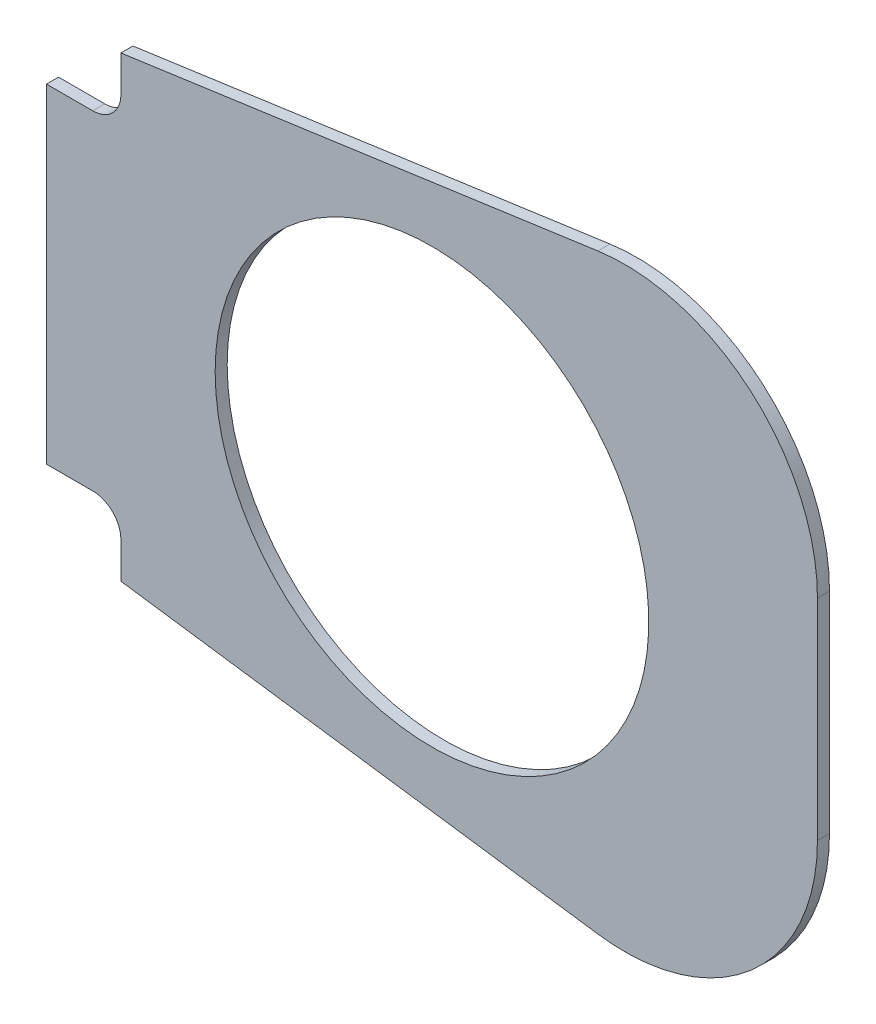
ISO-10303-21;
HEADER;
FILE_DESCRIPTION(('STEP AP214'),'2;1');
FILE_NAME('part.step','',(''),(''),'','','');
FILE_SCHEMA(('AUTOMOTIVE_DESIGN { 1 0 10303 214 1 1 1 1 }'));
ENDSEC;
DATA;
#1=APPLICATION_CONTEXT('core data for automotive mechanical design processes');
#2=APPLICATION_PROTOCOL_DEFINITION('international standard','automotive_design',2000,#1);
#3=PRODUCT_CONTEXT('',#1,'mechanical');
#4=PRODUCT('Part','Part','',(#3));
#5=PRODUCT_RELATED_PRODUCT_CATEGORY('part','',(#4));
#6=PRODUCT_DEFINITION_FORMATION('','',#4);
#7=PRODUCT_DEFINITION_CONTEXT('part definition',#1,'design');
#8=PRODUCT_DEFINITION('design','',#6,#7);
#9=PRODUCT_DEFINITION_SHAPE('','',#8);
#10=(LENGTH_UNIT() NAMED_UNIT(*) SI_UNIT(.MILLI.,.METRE.));
#11=(NAMED_UNIT(*) PLANE_ANGLE_UNIT() SI_UNIT($,.RADIAN.));
#12=(NAMED_UNIT(*) SI_UNIT($,.STERADIAN.) SOLID_ANGLE_UNIT());
#13=UNCERTAINTY_MEASURE_WITH_UNIT(LENGTH_MEASURE(1.E-05),#10,'distance_accuracy_value','');
#14=(GEOMETRIC_REPRESENTATION_CONTEXT(3) GLOBAL_UNCERTAINTY_ASSIGNED_CONTEXT((#13)) GLOBAL_UNIT_ASSIGNED_CONTEXT((#10,
#11,#12)) REPRESENTATION_CONTEXT('',''));
#15=CARTESIAN_POINT('',(0.,0.,0.));
#16=DIRECTION('',(0.,0.,1.));
#17=DIRECTION('',(1.,0.,0.));
#18=AXIS2_PLACEMENT_3D('',#15,#16,#17);
#19=CARTESIAN_POINT('',(1.52400000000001,-6.35,0.1984375));
#20=DIRECTION('',(0.,0.,-0.999999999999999));
#21=DIRECTION('',(-1.,0.,0.));
#22=AXIS2_PLACEMENT_3D('',#19,#20,#21);
#23=PLANE('',#22);
#24=DIRECTION('',(0.990268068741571,-0.139173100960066,0.));
#25=VECTOR('',#24,1.);
#26=CARTESIAN_POINT('',(18.1662508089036,-9.74559857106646,0.1984375));
#27=LINE('',#26,#25);
#28=CARTESIAN_POINT('',(2.4511,-7.53697815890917,0.1984375));
#29=VERTEX_POINT('',#28);
#30=CARTESIAN_POINT('',(18.1662508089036,-9.74559857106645,0.1984375));
#31=VERTEX_POINT('',#30);
#32=EDGE_CURVE('E180',#29,#31,#27,.T.);
#33=ORIENTED_EDGE('',*,*,#32,.T.);
#34=CARTESIAN_POINT('',(19.05,-3.45739633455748,0.1984375));
#35=DIRECTION('',(0.,0.,0.999999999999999));
#36=DIRECTION('',(-1.,0.,0.));
#37=AXIS2_PLACEMENT_3D('',#34,#35,#36);
#38=CIRCLE('',#37,6.35);
#39=CARTESIAN_POINT('',(25.4,-3.45739633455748,0.1984375));
#40=VERTEX_POINT('',#39);
#41=EDGE_CURVE('E108',#31,#40,#38,.T.);
#42=ORIENTED_EDGE('',*,*,#41,.T.);
#43=DIRECTION('',(0.,1.,0.));
#44=VECTOR('',#43,1.);
#45=CARTESIAN_POINT('',(25.4,-3.45739633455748,0.1984375));
#46=LINE('',#45,#44);
#47=CARTESIAN_POINT('',(25.4,3.45739633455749,0.1984375));
#48=VERTEX_POINT('',#47);
#49=EDGE_CURVE('E207',#40,#48,#46,.T.);
#50=ORIENTED_EDGE('',*,*,#49,.T.);
#51=CARTESIAN_POINT('',(19.05,3.45739633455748,0.1984375));
#52=DIRECTION('',(0.,0.,0.999999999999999));
#53=DIRECTION('',(1.,0.,0.));
#54=AXIS2_PLACEMENT_3D('',#51,#52,#53);
#55=CIRCLE('',#54,6.35);
#56=CARTESIAN_POINT('',(18.1662508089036,9.74559857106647,0.1984375));
#57=VERTEX_POINT('',#56);
#58=EDGE_CURVE('E226',#48,#57,#55,.T.);
#59=ORIENTED_EDGE('',*,*,#58,.T.);
#60=DIRECTION('',(-0.990268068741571,-0.139173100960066,0.));
#61=VECTOR('',#60,1.);
#62=CARTESIAN_POINT('',(18.1662508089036,9.74559857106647,0.1984375));
#63=LINE('',#62,#61);
#64=CARTESIAN_POINT('',(2.4511,7.53697815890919,0.1984375));
#65=VERTEX_POINT('',#64);
#66=EDGE_CURVE('E223',#57,#65,#63,.T.);
#67=ORIENTED_EDGE('',*,*,#66,.T.);
#68=DIRECTION('',(0.,-1.,0.));
#69=VECTOR('',#68,1.);
#70=CARTESIAN_POINT('',(2.4511,7.53697815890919,0.1984375));
#71=LINE('',#70,#69);
#72=CARTESIAN_POINT('',(2.4511,6.34999999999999,0.1984375));
#73=VERTEX_POINT('',#72);
#74=EDGE_CURVE('E225',#65,#73,#71,.T.);
#75=ORIENTED_EDGE('',*,*,#74,.T.);
#76=CARTESIAN_POINT('',(1.524,6.35000000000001,0.1984375));
#77=DIRECTION('',(0.,0.,-0.999999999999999));
#78=DIRECTION('',(1.,0.,0.));
#79=AXIS2_PLACEMENT_3D('',#76,#77,#78);
#80=CIRCLE('',#79,0.927099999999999);
#81=CARTESIAN_POINT('',(1.52400000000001,5.42290000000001,0.1984375));
#82=VERTEX_POINT('',#81);
#83=EDGE_CURVE('E228',#73,#82,#80,.T.);
#84=ORIENTED_EDGE('',*,*,#83,.T.);
#85=DIRECTION('',(-1.,0.,0.));
#86=VECTOR('',#85,1.);
#87=CARTESIAN_POINT('',(0.,5.4229,0.1984375));
#88=LINE('',#87,#86);
#89=CARTESIAN_POINT('',(0.,5.4229,0.1984375));
#90=VERTEX_POINT('',#89);
#91=EDGE_CURVE('E234',#82,#90,#88,.T.);
#92=ORIENTED_EDGE('',*,*,#91,.T.);
#93=DIRECTION('',(0.,-1.,0.));
#94=VECTOR('',#93,1.);
#95=CARTESIAN_POINT('',(0.,-5.4229,0.1984375));
#96=LINE('',#95,#94);
#97=CARTESIAN_POINT('',(0.,-5.4229,0.1984375));
#98=VERTEX_POINT('',#97);
#99=EDGE_CURVE('E139',#90,#98,#96,.T.);
#100=ORIENTED_EDGE('',*,*,#99,.T.);
#101=DIRECTION('',(1.,0.,0.));
#102=VECTOR('',#101,1.);
#103=CARTESIAN_POINT('',(0.,-5.4229,0.1984375));
#104=LINE('',#103,#102);
#105=CARTESIAN_POINT('',(1.524,-5.42289999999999,0.1984375));
#106=VERTEX_POINT('',#105);
#107=EDGE_CURVE('E133',#98,#106,#104,.T.);
#108=ORIENTED_EDGE('',*,*,#107,.T.);
#109=CARTESIAN_POINT('',(1.52400000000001,-6.35,0.1984375));
#110=DIRECTION('',(0.,0.,-0.999999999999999));
#111=DIRECTION('',(-1.,0.,0.));
#112=AXIS2_PLACEMENT_3D('',#109,#110,#111);
#113=CIRCLE('',#112,0.9271);
#114=CARTESIAN_POINT('',(2.4511,-6.35,0.1984375));
#115=VERTEX_POINT('',#114);
#116=EDGE_CURVE('E137',#106,#115,#113,.T.);
#117=ORIENTED_EDGE('',*,*,#116,.T.);
#118=DIRECTION('',(0.,-1.,0.));
#119=VECTOR('',#118,1.);
#120=CARTESIAN_POINT('',(2.4511,-6.35,0.1984375));
#121=LINE('',#120,#119);
#122=EDGE_CURVE('E53',#115,#29,#121,.T.);
#123=ORIENTED_EDGE('',*,*,#122,.T.);
#124=EDGE_LOOP('',(#33,#42,#50,#59,#67,#75,#84,#92,#100,#108,#117,#123));
#125=FACE_BOUND('',#124,.T.);
#126=CARTESIAN_POINT('',(12.7,0.,0.1984375));
#127=DIRECTION('',(0.,0.,0.999999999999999));
#128=DIRECTION('',(1.,0.,0.));
#129=AXIS2_PLACEMENT_3D('',#126,#127,#128);
#130=CIRCLE('',#129,7.14375);
#131=CARTESIAN_POINT('',(5.55625000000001,0.,0.1984375));
#132=VERTEX_POINT('',#131);
#133=EDGE_CURVE('E161',#132,#132,#130,.T.);
#134=ORIENTED_EDGE('',*,*,#133,.F.);
#135=EDGE_LOOP('',(#134));
#136=FACE_BOUND('',#135,.T.);
#137=ADVANCED_FACE('F36',(#125,#136),#23,.F.);
#138=CARTESIAN_POINT('',(1.52400000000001,-6.35,-0.1984375));
#139=DIRECTION('',(0.,0.,-0.999999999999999));
#140=DIRECTION('',(-1.,0.,0.));
#141=AXIS2_PLACEMENT_3D('',#138,#139,#140);
#142=PLANE('',#141);
#143=DIRECTION('',(0.990268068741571,-0.139173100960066,0.));
#144=VECTOR('',#143,1.);
#145=CARTESIAN_POINT('',(18.1662508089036,-9.74559857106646,-0.1984375));
#146=LINE('',#145,#144);
#147=CARTESIAN_POINT('',(2.4511,-7.53697815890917,-0.1984375));
#148=VERTEX_POINT('',#147);
#149=CARTESIAN_POINT('',(18.1662508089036,-9.74559857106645,-0.1984375));
#150=VERTEX_POINT('',#149);
#151=EDGE_CURVE('E157',#148,#150,#146,.T.);
#152=ORIENTED_EDGE('',*,*,#151,.F.);
#153=DIRECTION('',(0.,-1.,0.));
#154=VECTOR('',#153,1.);
#155=CARTESIAN_POINT('',(2.4511,-6.35,-0.1984375));
#156=LINE('',#155,#154);
#157=CARTESIAN_POINT('',(2.4511,-6.35,-0.1984375));
#158=VERTEX_POINT('',#157);
#159=EDGE_CURVE('E100',#158,#148,#156,.T.);
#160=ORIENTED_EDGE('',*,*,#159,.F.);
#161=CARTESIAN_POINT('',(1.52400000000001,-6.35,-0.1984375));
#162=DIRECTION('',(0.,0.,-0.999999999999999));
#163=DIRECTION('',(-1.,0.,0.));
#164=AXIS2_PLACEMENT_3D('',#161,#162,#163);
#165=CIRCLE('',#164,0.9271);
#166=CARTESIAN_POINT('',(1.52400000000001,-5.4229,-0.1984375));
#167=VERTEX_POINT('',#166);
#168=EDGE_CURVE('E94',#167,#158,#165,.T.);
#169=ORIENTED_EDGE('',*,*,#168,.F.);
#170=DIRECTION('',(1.,0.,0.));
#171=VECTOR('',#170,1.);
#172=CARTESIAN_POINT('',(0.,-5.4229,-0.1984375));
#173=LINE('',#172,#171);
#174=CARTESIAN_POINT('',(0.,-5.4229,-0.1984375));
#175=VERTEX_POINT('',#174);
#176=EDGE_CURVE('E147',#175,#167,#173,.T.);
#177=ORIENTED_EDGE('',*,*,#176,.F.);
#178=DIRECTION('',(0.,-1.,0.));
#179=VECTOR('',#178,1.);
#180=CARTESIAN_POINT('',(0.,-5.4229,-0.1984375));
#181=LINE('',#180,#179);
#182=CARTESIAN_POINT('',(0.,5.4229,-0.1984375));
#183=VERTEX_POINT('',#182);
#184=EDGE_CURVE('E175',#183,#175,#181,.T.);
#185=ORIENTED_EDGE('',*,*,#184,.F.);
#186=DIRECTION('',(-1.,0.,0.));
#187=VECTOR('',#186,1.);
#188=CARTESIAN_POINT('',(0.,5.4229,-0.1984375));
#189=LINE('',#188,#187);
#190=CARTESIAN_POINT('',(1.52400000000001,5.42290000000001,-0.1984375));
#191=VERTEX_POINT('',#190);
#192=EDGE_CURVE('E173',#191,#183,#189,.T.);
#193=ORIENTED_EDGE('',*,*,#192,.F.);
#194=CARTESIAN_POINT('',(1.524,6.35000000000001,-0.1984375));
#195=DIRECTION('',(0.,0.,-0.999999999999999));
#196=DIRECTION('',(1.,0.,0.));
#197=AXIS2_PLACEMENT_3D('',#194,#195,#196);
#198=CIRCLE('',#197,0.927099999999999);
#199=CARTESIAN_POINT('',(2.4511,6.34999999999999,-0.1984375));
#200=VERTEX_POINT('',#199);
#201=EDGE_CURVE('E171',#200,#191,#198,.T.);
#202=ORIENTED_EDGE('',*,*,#201,.F.);
#203=DIRECTION('',(0.,-1.,0.));
#204=VECTOR('',#203,1.);
#205=CARTESIAN_POINT('',(2.4511,7.53697815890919,-0.1984375));
#206=LINE('',#205,#204);
#207=CARTESIAN_POINT('',(2.4511,7.53697815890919,-0.1984375));
#208=VERTEX_POINT('',#207);
#209=EDGE_CURVE('E169',#208,#200,#206,.T.);
#210=ORIENTED_EDGE('',*,*,#209,.F.);
#211=DIRECTION('',(-0.990268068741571,-0.139173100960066,0.));
#212=VECTOR('',#211,1.);
#213=CARTESIAN_POINT('',(18.1662508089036,9.74559857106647,-0.1984375));
#214=LINE('',#213,#212);
#215=CARTESIAN_POINT('',(18.1662508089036,9.74559857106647,-0.1984375));
#216=VERTEX_POINT('',#215);
#217=EDGE_CURVE('E167',#216,#208,#214,.T.);
#218=ORIENTED_EDGE('',*,*,#217,.F.);
#219=CARTESIAN_POINT('',(19.05,3.45739633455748,-0.1984375));
#220=DIRECTION('',(0.,0.,0.999999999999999));
#221=DIRECTION('',(1.,0.,0.));
#222=AXIS2_PLACEMENT_3D('',#219,#220,#221);
#223=CIRCLE('',#222,6.35);
#224=CARTESIAN_POINT('',(25.4,3.45739633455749,-0.1984375));
#225=VERTEX_POINT('',#224);
#226=EDGE_CURVE('E165',#225,#216,#223,.T.);
#227=ORIENTED_EDGE('',*,*,#226,.F.);
#228=DIRECTION('',(0.,1.,0.));
#229=VECTOR('',#228,1.);
#230=CARTESIAN_POINT('',(25.4,-3.45739633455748,-0.1984375));
#231=LINE('',#230,#229);
#232=CARTESIAN_POINT('',(25.4,-3.45739633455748,-0.1984375));
#233=VERTEX_POINT('',#232);
#234=EDGE_CURVE('E163',#233,#225,#231,.T.);
#235=ORIENTED_EDGE('',*,*,#234,.F.);
#236=CARTESIAN_POINT('',(19.05,-3.45739633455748,-0.1984375));
#237=DIRECTION('',(0.,0.,0.999999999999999));
#238=DIRECTION('',(-1.,0.,0.));
#239=AXIS2_PLACEMENT_3D('',#236,#237,#238);
#240=CIRCLE('',#239,6.35);
#241=EDGE_CURVE('E160',#150,#233,#240,.T.);
#242=ORIENTED_EDGE('',*,*,#241,.F.);
#243=EDGE_LOOP('',(#152,#160,#169,#177,#185,#193,#202,#210,#218,#227,#235,#242));
#244=FACE_BOUND('',#243,.T.);
#245=CARTESIAN_POINT('',(12.7,0.,-0.1984375));
#246=DIRECTION('',(0.,0.,0.999999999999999));
#247=DIRECTION('',(1.,0.,0.));
#248=AXIS2_PLACEMENT_3D('',#245,#246,#247);
#249=CIRCLE('',#248,7.14375);
#250=CARTESIAN_POINT('',(5.55625000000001,0.,-0.1984375));
#251=VERTEX_POINT('',#250);
#252=EDGE_CURVE('E351',#251,#251,#249,.T.);
#253=ORIENTED_EDGE('',*,*,#252,.T.);
#254=EDGE_LOOP('',(#253));
#255=FACE_BOUND('',#254,.T.);
#256=ADVANCED_FACE('F211',(#244,#255),#142,.T.);
#257=CARTESIAN_POINT('',(18.1662508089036,-9.74559857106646,0.1984375));
#258=DIRECTION('',(0.139173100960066,0.990268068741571,0.));
#259=DIRECTION('',(-0.990268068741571,0.139173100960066,0.));
#260=AXIS2_PLACEMENT_3D('',#257,#258,#259);
#261=PLANE('',#260);
#262=ORIENTED_EDGE('',*,*,#151,.T.);
#263=DIRECTION('',(0.,0.,-0.999999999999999));
#264=VECTOR('',#263,1.);
#265=CARTESIAN_POINT('',(18.1662508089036,-9.74559857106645,0.1984375));
#266=LINE('',#265,#264);
#267=EDGE_CURVE('E11',#31,#150,#266,.T.);
#268=ORIENTED_EDGE('',*,*,#267,.F.);
#269=ORIENTED_EDGE('',*,*,#32,.F.);
#270=DIRECTION('',(0.,0.,-0.999999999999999));
#271=VECTOR('',#270,1.);
#272=CARTESIAN_POINT('',(2.4511,-7.53697815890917,0.1984375));
#273=LINE('',#272,#271);
#274=EDGE_CURVE('E153',#29,#148,#273,.T.);
#275=ORIENTED_EDGE('',*,*,#274,.T.);
#276=EDGE_LOOP('',(#262,#268,#269,#275));
#277=FACE_BOUND('',#276,.T.);
#278=ADVANCED_FACE('F38',(#277),#261,.F.);
#279=CARTESIAN_POINT('',(19.05,-3.45739633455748,0.1984375));
#280=DIRECTION('',(0.,0.,-0.999999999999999));
#281=DIRECTION('',(-1.,0.,0.));
#282=AXIS2_PLACEMENT_3D('',#279,#280,#281);
#283=CYLINDRICAL_SURFACE('',#282,6.35);
#284=ORIENTED_EDGE('',*,*,#241,.T.);
#285=DIRECTION('',(0.,0.,-0.999999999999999));
#286=VECTOR('',#285,1.);
#287=CARTESIAN_POINT('',(25.4,-3.45739633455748,0.1984375));
#288=LINE('',#287,#286);
#289=EDGE_CURVE('E45',#40,#233,#288,.T.);
#290=ORIENTED_EDGE('',*,*,#289,.F.);
#291=ORIENTED_EDGE('',*,*,#41,.F.);
#292=ORIENTED_EDGE('',*,*,#267,.T.);
#293=EDGE_LOOP('',(#284,#290,#291,#292));
#294=FACE_BOUND('',#293,.T.);
#295=ADVANCED_FACE('F268',(#294),#283,.T.);
#296=CARTESIAN_POINT('',(25.4,-3.45739633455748,0.1984375));
#297=DIRECTION('',(-1.,0.,0.));
#298=DIRECTION('',(0.,-1.,0.));
#299=AXIS2_PLACEMENT_3D('',#296,#297,#298);
#300=PLANE('',#299);
#301=ORIENTED_EDGE('',*,*,#234,.T.);
#302=DIRECTION('',(0.,0.,-0.999999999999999));
#303=VECTOR('',#302,1.);
#304=CARTESIAN_POINT('',(25.4,3.45739633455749,0.1984375));
#305=LINE('',#304,#303);
#306=EDGE_CURVE('E199',#48,#225,#305,.T.);
#307=ORIENTED_EDGE('',*,*,#306,.F.);
#308=ORIENTED_EDGE('',*,*,#49,.F.);
#309=ORIENTED_EDGE('',*,*,#289,.T.);
#310=EDGE_LOOP('',(#301,#307,#308,#309));
#311=FACE_BOUND('',#310,.T.);
#312=ADVANCED_FACE('F205',(#311),#300,.F.);
#313=CARTESIAN_POINT('',(19.05,3.45739633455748,0.1984375));
#314=DIRECTION('',(0.,0.,-0.999999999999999));
#315=DIRECTION('',(-1.,0.,0.));
#316=AXIS2_PLACEMENT_3D('',#313,#314,#315);
#317=CYLINDRICAL_SURFACE('',#316,6.35);
#318=ORIENTED_EDGE('',*,*,#226,.T.);
#319=DIRECTION('',(0.,0.,-0.999999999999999));
#320=VECTOR('',#319,1.);
#321=CARTESIAN_POINT('',(18.1662508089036,9.74559857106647,0.1984375));
#322=LINE('',#321,#320);
#323=EDGE_CURVE('E196',#57,#216,#322,.T.);
#324=ORIENTED_EDGE('',*,*,#323,.F.);
#325=ORIENTED_EDGE('',*,*,#58,.F.);
#326=ORIENTED_EDGE('',*,*,#306,.T.);
#327=EDGE_LOOP('',(#318,#324,#325,#326));
#328=FACE_BOUND('',#327,.T.);
#329=ADVANCED_FACE('F217',(#328),#317,.T.);
#330=CARTESIAN_POINT('',(18.1662508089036,9.74559857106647,0.1984375));
#331=DIRECTION('',(0.139173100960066,-0.990268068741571,0.));
#332=DIRECTION('',(0.990268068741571,0.139173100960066,0.));
#333=AXIS2_PLACEMENT_3D('',#330,#331,#332);
#334=PLANE('',#333);
#335=ORIENTED_EDGE('',*,*,#217,.T.);
#336=DIRECTION('',(0.,0.,-0.999999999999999));
#337=VECTOR('',#336,1.);
#338=CARTESIAN_POINT('',(2.4511,7.53697815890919,0.1984375));
#339=LINE('',#338,#337);
#340=EDGE_CURVE('E193',#65,#208,#339,.T.);
#341=ORIENTED_EDGE('',*,*,#340,.F.);
#342=ORIENTED_EDGE('',*,*,#66,.F.);
#343=ORIENTED_EDGE('',*,*,#323,.T.);
#344=EDGE_LOOP('',(#335,#341,#342,#343));
#345=FACE_BOUND('',#344,.T.);
#346=ADVANCED_FACE('F221',(#345),#334,.F.);
#347=CARTESIAN_POINT('',(2.4511,7.53697815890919,0.1984375));
#348=DIRECTION('',(1.,0.,0.));
#349=DIRECTION('',(0.,1.,0.));
#350=AXIS2_PLACEMENT_3D('',#347,#348,#349);
#351=PLANE('',#350);
#352=ORIENTED_EDGE('',*,*,#209,.T.);
#353=DIRECTION('',(0.,0.,-0.999999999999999));
#354=VECTOR('',#353,1.);
#355=CARTESIAN_POINT('',(2.4511,6.34999999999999,0.1984375));
#356=LINE('',#355,#354);
#357=EDGE_CURVE('E190',#73,#200,#356,.T.);
#358=ORIENTED_EDGE('',*,*,#357,.F.);
#359=ORIENTED_EDGE('',*,*,#74,.F.);
#360=ORIENTED_EDGE('',*,*,#340,.T.);
#361=EDGE_LOOP('',(#352,#358,#359,#360));
#362=FACE_BOUND('',#361,.T.);
#363=ADVANCED_FACE('F281',(#362),#351,.F.);
#364=CARTESIAN_POINT('',(1.524,6.35000000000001,0.1984375));
#365=DIRECTION('',(0.,0.,-0.999999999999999));
#366=DIRECTION('',(-1.,0.,0.));
#367=AXIS2_PLACEMENT_3D('',#364,#365,#366);
#368=CYLINDRICAL_SURFACE('',#367,0.927099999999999);
#369=ORIENTED_EDGE('',*,*,#201,.T.);
#370=DIRECTION('',(0.,0.,-0.999999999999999));
#371=VECTOR('',#370,1.);
#372=CARTESIAN_POINT('',(1.52400000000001,5.42290000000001,0.1984375));
#373=LINE('',#372,#371);
#374=EDGE_CURVE('E187',#82,#191,#373,.T.);
#375=ORIENTED_EDGE('',*,*,#374,.F.);
#376=ORIENTED_EDGE('',*,*,#83,.F.);
#377=ORIENTED_EDGE('',*,*,#357,.T.);
#378=EDGE_LOOP('',(#369,#375,#376,#377));
#379=FACE_BOUND('',#378,.T.);
#380=ADVANCED_FACE('F284',(#379),#368,.F.);
#381=CARTESIAN_POINT('',(0.,5.4229,0.1984375));
#382=DIRECTION('',(0.,-1.,0.));
#383=DIRECTION('',(0.,0.,-0.999999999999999));
#384=AXIS2_PLACEMENT_3D('',#381,#382,#383);
#385=PLANE('',#384);
#386=ORIENTED_EDGE('',*,*,#192,.T.);
#387=DIRECTION('',(0.,0.,-0.999999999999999));
#388=VECTOR('',#387,1.);
#389=CARTESIAN_POINT('',(0.,5.4229,0.1984375));
#390=LINE('',#389,#388);
#391=EDGE_CURVE('E184',#90,#183,#390,.T.);
#392=ORIENTED_EDGE('',*,*,#391,.F.);
#393=ORIENTED_EDGE('',*,*,#91,.F.);
#394=ORIENTED_EDGE('',*,*,#374,.T.);
#395=EDGE_LOOP('',(#386,#392,#393,#394));
#396=FACE_BOUND('',#395,.T.);
#397=ADVANCED_FACE('F240',(#396),#385,.F.);
#398=CARTESIAN_POINT('',(0.,-5.4229,0.1984375));
#399=DIRECTION('',(1.,0.,0.));
#400=DIRECTION('',(0.,0.,-0.999999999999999));
#401=AXIS2_PLACEMENT_3D('',#398,#399,#400);
#402=PLANE('',#401);
#403=ORIENTED_EDGE('',*,*,#184,.T.);
#404=DIRECTION('',(0.,0.,-0.999999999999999));
#405=VECTOR('',#404,1.);
#406=CARTESIAN_POINT('',(0.,-5.4229,0.1984375));
#407=LINE('',#406,#405);
#408=EDGE_CURVE('E148',#98,#175,#407,.T.);
#409=ORIENTED_EDGE('',*,*,#408,.F.);
#410=ORIENTED_EDGE('',*,*,#99,.F.);
#411=ORIENTED_EDGE('',*,*,#391,.T.);
#412=EDGE_LOOP('',(#403,#409,#410,#411));
#413=FACE_BOUND('',#412,.T.);
#414=ADVANCED_FACE('F244',(#413),#402,.F.);
#415=CARTESIAN_POINT('',(0.,-5.4229,0.1984375));
#416=DIRECTION('',(0.,1.,0.));
#417=DIRECTION('',(0.,0.,0.999999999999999));
#418=AXIS2_PLACEMENT_3D('',#415,#416,#417);
#419=PLANE('',#418);
#420=ORIENTED_EDGE('',*,*,#176,.T.);
#421=DIRECTION('',(0.,0.,-0.999999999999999));
#422=VECTOR('',#421,1.);
#423=CARTESIAN_POINT('',(1.524,-5.42289999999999,0.1984375));
#424=LINE('',#423,#422);
#425=EDGE_CURVE('E144',#106,#167,#424,.T.);
#426=ORIENTED_EDGE('',*,*,#425,.F.);
#427=ORIENTED_EDGE('',*,*,#107,.F.);
#428=ORIENTED_EDGE('',*,*,#408,.T.);
#429=EDGE_LOOP('',(#420,#426,#427,#428));
#430=FACE_BOUND('',#429,.T.);
#431=ADVANCED_FACE('F145',(#430),#419,.F.);
#432=CARTESIAN_POINT('',(1.52400000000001,-6.35,0.1984375));
#433=DIRECTION('',(0.,0.,-0.999999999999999));
#434=DIRECTION('',(-1.,0.,0.));
#435=AXIS2_PLACEMENT_3D('',#432,#433,#434);
#436=CYLINDRICAL_SURFACE('',#435,0.9271);
#437=ORIENTED_EDGE('',*,*,#168,.T.);
#438=DIRECTION('',(0.,0.,-0.999999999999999));
#439=VECTOR('',#438,1.);
#440=CARTESIAN_POINT('',(2.4511,-6.35,0.1984375));
#441=LINE('',#440,#439);
#442=EDGE_CURVE('E149',#115,#158,#441,.T.);
#443=ORIENTED_EDGE('',*,*,#442,.F.);
#444=ORIENTED_EDGE('',*,*,#116,.F.);
#445=ORIENTED_EDGE('',*,*,#425,.T.);
#446=EDGE_LOOP('',(#437,#443,#444,#445));
#447=FACE_BOUND('',#446,.T.);
#448=ADVANCED_FACE('F151',(#447),#436,.F.);
#449=CARTESIAN_POINT('',(2.4511,-6.35,0.1984375));
#450=DIRECTION('',(1.,0.,0.));
#451=DIRECTION('',(0.,1.,0.));
#452=AXIS2_PLACEMENT_3D('',#449,#450,#451);
#453=PLANE('',#452);
#454=ORIENTED_EDGE('',*,*,#159,.T.);
#455=ORIENTED_EDGE('',*,*,#274,.F.);
#456=ORIENTED_EDGE('',*,*,#122,.F.);
#457=ORIENTED_EDGE('',*,*,#442,.T.);
#458=EDGE_LOOP('',(#454,#455,#456,#457));
#459=FACE_BOUND('',#458,.T.);
#460=ADVANCED_FACE('F248',(#459),#453,.F.);
#461=CARTESIAN_POINT('',(12.7,0.,0.1984375));
#462=DIRECTION('',(0.,0.,-0.999999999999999));
#463=DIRECTION('',(-1.,0.,0.));
#464=AXIS2_PLACEMENT_3D('',#461,#462,#463);
#465=CYLINDRICAL_SURFACE('',#464,7.14375);
#466=CARTESIAN_POINT('',(5.55625000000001,0.,0.1984375));
#467=CARTESIAN_POINT('',(5.55625000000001,0.,0.194303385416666));
#468=CARTESIAN_POINT('',(5.55625000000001,0.,0.190169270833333));
#469=CARTESIAN_POINT('',(5.55625000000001,0.,0.181901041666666));
#470=CARTESIAN_POINT('',(5.55625000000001,0.,0.177766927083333));
#471=CARTESIAN_POINT('',(5.55625000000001,0.,0.169498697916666));
#472=CARTESIAN_POINT('',(5.55625000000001,0.,0.165364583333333));
#473=CARTESIAN_POINT('',(5.55625000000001,0.,0.157096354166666));
#474=CARTESIAN_POINT('',(5.55625000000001,0.,0.152962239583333));
#475=CARTESIAN_POINT('',(5.55625000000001,0.,0.144694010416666));
#476=CARTESIAN_POINT('',(5.55625000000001,0.,0.140559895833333));
#477=CARTESIAN_POINT('',(5.55625000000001,0.,0.132291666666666));
#478=CARTESIAN_POINT('',(5.55625000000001,0.,0.128157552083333));
#479=CARTESIAN_POINT('',(5.55625000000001,0.,0.119889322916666));
#480=CARTESIAN_POINT('',(5.55625000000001,0.,0.115755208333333));
#481=CARTESIAN_POINT('',(5.55625000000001,0.,0.107486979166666));
#482=CARTESIAN_POINT('',(5.55625000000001,0.,0.103352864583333));
#483=CARTESIAN_POINT('',(5.55625000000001,0.,0.0950846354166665));
#484=CARTESIAN_POINT('',(5.55625000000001,0.,0.0909505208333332));
#485=CARTESIAN_POINT('',(5.55625000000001,0.,0.0826822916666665));
#486=CARTESIAN_POINT('',(5.55625000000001,0.,0.0785481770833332));
#487=CARTESIAN_POINT('',(5.55625000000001,0.,0.0702799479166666));
#488=CARTESIAN_POINT('',(5.55625000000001,0.,0.0661458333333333));
#489=CARTESIAN_POINT('',(5.55625000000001,0.,0.0578776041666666));
#490=CARTESIAN_POINT('',(5.55625000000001,0.,0.0537434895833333));
#491=CARTESIAN_POINT('',(5.55625000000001,0.,0.0454752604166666));
#492=CARTESIAN_POINT('',(5.55625000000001,0.,0.0413411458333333));
#493=CARTESIAN_POINT('',(5.55625000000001,0.,0.0330729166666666));
#494=CARTESIAN_POINT('',(5.55625000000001,0.,0.0289388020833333));
#495=CARTESIAN_POINT('',(5.55625000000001,0.,0.0206705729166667));
#496=CARTESIAN_POINT('',(5.55625000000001,0.,0.0165364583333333));
#497=CARTESIAN_POINT('',(5.55625000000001,0.,0.00826822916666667));
#498=CARTESIAN_POINT('',(5.55625000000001,0.,0.00413411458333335));
#499=CARTESIAN_POINT('',(5.55625000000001,0.,-0.0041341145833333));
#500=CARTESIAN_POINT('',(5.55625000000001,0.,-0.00826822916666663));
#501=CARTESIAN_POINT('',(5.55625000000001,0.,-0.0165364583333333));
#502=CARTESIAN_POINT('',(5.55625000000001,0.,-0.0206705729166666));
#503=CARTESIAN_POINT('',(5.55625000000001,0.,-0.0289388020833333));
#504=CARTESIAN_POINT('',(5.55625000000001,0.,-0.0330729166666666));
#505=CARTESIAN_POINT('',(5.55625000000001,0.,-0.0413411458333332));
#506=CARTESIAN_POINT('',(5.55625000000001,0.,-0.0454752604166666));
#507=CARTESIAN_POINT('',(5.55625000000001,0.,-0.0537434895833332));
#508=CARTESIAN_POINT('',(5.55625000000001,0.,-0.0578776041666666));
#509=CARTESIAN_POINT('',(5.55625000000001,0.,-0.0661458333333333));
#510=CARTESIAN_POINT('',(5.55625000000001,0.,-0.0702799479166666));
#511=CARTESIAN_POINT('',(5.55625000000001,0.,-0.0785481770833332));
#512=CARTESIAN_POINT('',(5.55625000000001,0.,-0.0826822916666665));
#513=CARTESIAN_POINT('',(5.55625000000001,0.,-0.0909505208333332));
#514=CARTESIAN_POINT('',(5.55625000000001,0.,-0.0950846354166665));
#515=CARTESIAN_POINT('',(5.55625000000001,0.,-0.103352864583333));
#516=CARTESIAN_POINT('',(5.55625000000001,0.,-0.107486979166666));
#517=CARTESIAN_POINT('',(5.55625000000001,0.,-0.115755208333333));
#518=CARTESIAN_POINT('',(5.55625000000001,0.,-0.119889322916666));
#519=CARTESIAN_POINT('',(5.55625000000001,0.,-0.128157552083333));
#520=CARTESIAN_POINT('',(5.55625000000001,0.,-0.132291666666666));
#521=CARTESIAN_POINT('',(5.55625000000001,0.,-0.140559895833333));
#522=CARTESIAN_POINT('',(5.55625000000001,0.,-0.144694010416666));
#523=CARTESIAN_POINT('',(5.55625000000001,0.,-0.152962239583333));
#524=CARTESIAN_POINT('',(5.55625000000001,0.,-0.157096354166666));
#525=CARTESIAN_POINT('',(5.55625000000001,0.,-0.165364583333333));
#526=CARTESIAN_POINT('',(5.55625000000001,0.,-0.169498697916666));
#527=CARTESIAN_POINT('',(5.55625000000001,0.,-0.177766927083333));
#528=CARTESIAN_POINT('',(5.55625000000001,0.,-0.181901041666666));
#529=CARTESIAN_POINT('',(5.55625000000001,0.,-0.190169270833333));
#530=CARTESIAN_POINT('',(5.55625000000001,0.,-0.194303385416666));
#531=CARTESIAN_POINT('',(5.55625000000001,0.,-0.1984375));
#532=B_SPLINE_CURVE_WITH_KNOTS('',3,(#466,#467,#468,#469,#470,#471,#472,#473,#474,#475,#476,
#477,#478,#479,#480,#481,#482,#483,#484,#485,#486,#487,#488,#489,#490,#491,#492,#493,#494,#495,
#496,#497,#498,#499,#500,#501,#502,#503,#504,#505,#506,#507,#508,#509,#510,#511,#512,#513,#514,
#515,#516,#517,#518,#519,#520,#521,#522,#523,#524,#525,#526,#527,#528,#529,#530,#531),
.UNSPECIFIED.,.F.,.F.,(4,2,2,2,2,2,2,2,2,2,2,2,2,2,2,2,2,2,2,2,2,2,2,2,2,2,2,2,2,2,2,2,4),(0.,
0.01240234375,0.0248046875,0.0372070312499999,0.0496093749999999,0.0620117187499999,
0.0744140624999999,0.0868164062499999,0.0992187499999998,0.11162109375,0.1240234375,
0.13642578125,0.148828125,0.16123046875,0.1736328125,0.18603515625,0.1984375,0.21083984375,
0.2232421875,0.23564453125,0.248046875,0.26044921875,0.2728515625,0.28525390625,0.29765625,
0.310058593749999,0.322460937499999,0.334863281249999,0.347265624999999,0.359667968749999,
0.372070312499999,0.384472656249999,0.396874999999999),.UNSPECIFIED.);
#533=EDGE_CURVE('BSEAM250',#132,#251,#532,.T.);
#534=ORIENTED_EDGE('',*,*,#133,.T.);
#535=ORIENTED_EDGE('',*,*,#252,.F.);
#536=ORIENTED_EDGE('',*,*,#533,.T.);
#537=ORIENTED_EDGE('',*,*,#533,.F.);
#538=EDGE_LOOP('',(#534,#536,#535,#537));
#539=FACE_BOUND('',#538,.T.);
#540=ADVANCED_FACE('F250',(#539),#465,.F.);
#541=CLOSED_SHELL('',(#137,#256,#278,#295,#312,#329,#346,#363,#380,#397,#414,#431,#448,#460,#540));
#542=MANIFOLD_SOLID_BREP('B2',#541);
#543=ADVANCED_BREP_SHAPE_REPRESENTATION('',(#18,#542),#14);
#544=SHAPE_DEFINITION_REPRESENTATION(#9,#543);
ENDSEC;
END-ISO-10303-21;
